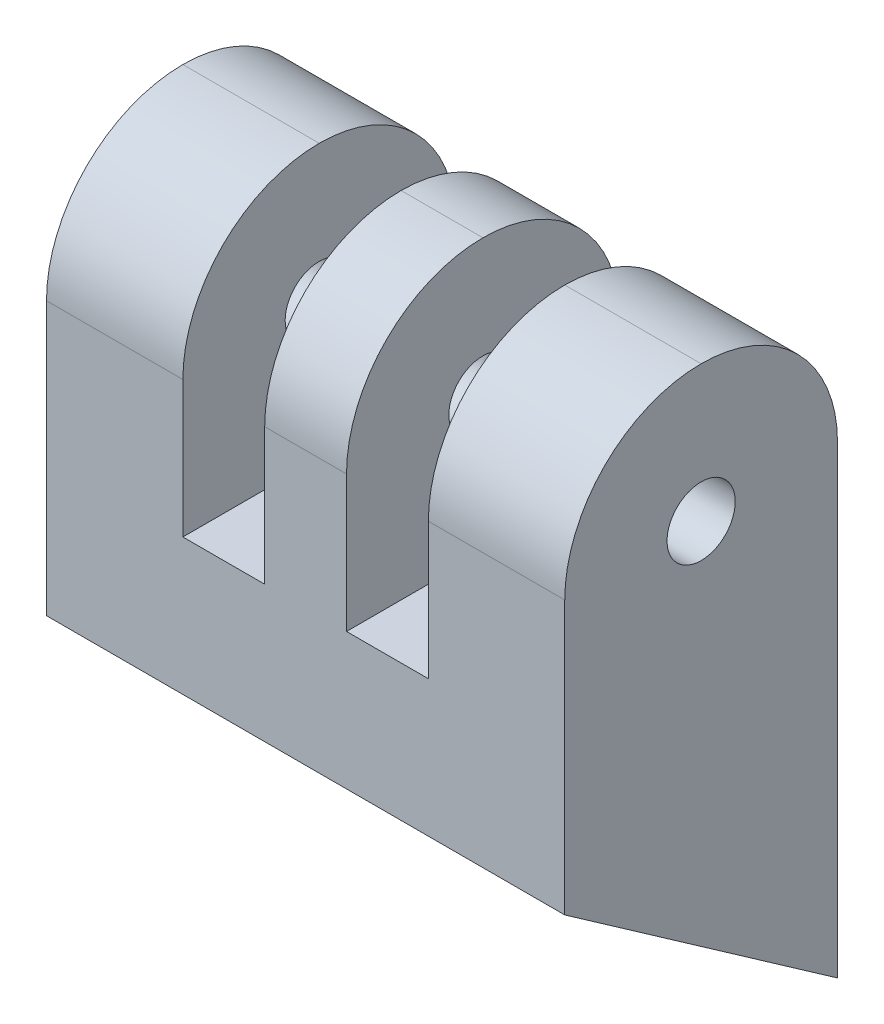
ISO-10303-21;
HEADER;
FILE_DESCRIPTION(('STEP AP214'),'2;1');
FILE_NAME('part.step','',(''),(''),'','','');
FILE_SCHEMA(('AUTOMOTIVE_DESIGN { 1 0 10303 214 1 1 1 1 }'));
ENDSEC;
DATA;
#1=APPLICATION_CONTEXT('core data for automotive mechanical design processes');
#2=APPLICATION_PROTOCOL_DEFINITION('international standard','automotive_design',2000,#1);
#3=PRODUCT_CONTEXT('',#1,'mechanical');
#4=PRODUCT('Part','Part','',(#3));
#5=PRODUCT_RELATED_PRODUCT_CATEGORY('part','',(#4));
#6=PRODUCT_DEFINITION_FORMATION('','',#4);
#7=PRODUCT_DEFINITION_CONTEXT('part definition',#1,'design');
#8=PRODUCT_DEFINITION('design','',#6,#7);
#9=PRODUCT_DEFINITION_SHAPE('','',#8);
#10=(LENGTH_UNIT() NAMED_UNIT(*) SI_UNIT(.MILLI.,.METRE.));
#11=(NAMED_UNIT(*) PLANE_ANGLE_UNIT() SI_UNIT($,.RADIAN.));
#12=(NAMED_UNIT(*) SI_UNIT($,.STERADIAN.) SOLID_ANGLE_UNIT());
#13=UNCERTAINTY_MEASURE_WITH_UNIT(LENGTH_MEASURE(1.E-05),#10,'distance_accuracy_value','');
#14=(GEOMETRIC_REPRESENTATION_CONTEXT(3) GLOBAL_UNCERTAINTY_ASSIGNED_CONTEXT((#13)) GLOBAL_UNIT_ASSIGNED_CONTEXT((#10,
#11,#12)) REPRESENTATION_CONTEXT('',''));
#15=CARTESIAN_POINT('',(0.,0.,0.));
#16=DIRECTION('',(0.,0.,1.));
#17=DIRECTION('',(1.,0.,0.));
#18=AXIS2_PLACEMENT_3D('',#15,#16,#17);
#19=CARTESIAN_POINT('',(0.,12.7,0.));
#20=DIRECTION('',(0.,-1.,0.));
#21=DIRECTION('',(0.,0.,-1.));
#22=AXIS2_PLACEMENT_3D('',#19,#20,#21);
#23=PLANE('',#22);
#24=DIRECTION('',(0.,0.,1.));
#25=VECTOR('',#24,1.);
#26=CARTESIAN_POINT('',(20.32,12.7,-25.4));
#27=LINE('',#26,#25);
#28=CARTESIAN_POINT('',(20.32,12.7,-25.4));
#29=VERTEX_POINT('',#28);
#30=CARTESIAN_POINT('',(20.32,12.7,0.));
#31=VERTEX_POINT('',#30);
#32=EDGE_CURVE('E188',#29,#31,#27,.T.);
#33=ORIENTED_EDGE('',*,*,#32,.F.);
#34=DIRECTION('',(-1.,0.,0.));
#35=VECTOR('',#34,1.);
#36=CARTESIAN_POINT('',(0.,12.7,-25.4));
#37=LINE('',#36,#35);
#38=CARTESIAN_POINT('',(12.7,12.7,-25.4));
#39=VERTEX_POINT('',#38);
#40=EDGE_CURVE('E218',#29,#39,#37,.T.);
#41=ORIENTED_EDGE('',*,*,#40,.T.);
#42=DIRECTION('',(0.,0.,-1.));
#43=VECTOR('',#42,1.);
#44=CARTESIAN_POINT('',(12.7,12.7,-25.4));
#45=LINE('',#44,#43);
#46=CARTESIAN_POINT('',(12.7,12.7,0.));
#47=VERTEX_POINT('',#46);
#48=EDGE_CURVE('E209',#47,#39,#45,.T.);
#49=ORIENTED_EDGE('',*,*,#48,.F.);
#50=DIRECTION('',(1.,0.,0.));
#51=VECTOR('',#50,1.);
#52=CARTESIAN_POINT('',(0.,12.7,0.));
#53=LINE('',#52,#51);
#54=EDGE_CURVE('E215',#47,#31,#53,.T.);
#55=ORIENTED_EDGE('',*,*,#54,.T.);
#56=EDGE_LOOP('',(#33,#41,#49,#55));
#57=FACE_BOUND('',#56,.T.);
#58=ADVANCED_FACE('F32',(#57),#23,.F.);
#59=DIRECTION('',(0.,0.,-1.));
#60=VECTOR('',#59,1.);
#61=CARTESIAN_POINT('',(27.94,12.7,-25.4));
#62=LINE('',#61,#60);
#63=CARTESIAN_POINT('',(27.94,12.7,0.));
#64=VERTEX_POINT('',#63);
#65=CARTESIAN_POINT('',(27.94,12.7,-25.4));
#66=VERTEX_POINT('',#65);
#67=EDGE_CURVE('E191',#64,#66,#62,.T.);
#68=ORIENTED_EDGE('',*,*,#67,.F.);
#69=CARTESIAN_POINT('',(35.56,12.7,0.));
#70=VERTEX_POINT('',#69);
#71=EDGE_CURVE('E159',#64,#70,#53,.T.);
#72=ORIENTED_EDGE('',*,*,#71,.T.);
#73=DIRECTION('',(0.,0.,1.));
#74=VECTOR('',#73,1.);
#75=CARTESIAN_POINT('',(35.56,12.7,-25.4));
#76=LINE('',#75,#74);
#77=CARTESIAN_POINT('',(35.56,12.7,-25.4));
#78=VERTEX_POINT('',#77);
#79=EDGE_CURVE('E202',#78,#70,#76,.T.);
#80=ORIENTED_EDGE('',*,*,#79,.F.);
#81=EDGE_CURVE('E219',#78,#66,#37,.T.);
#82=ORIENTED_EDGE('',*,*,#81,.T.);
#83=EDGE_LOOP('',(#68,#72,#80,#82));
#84=FACE_BOUND('',#83,.T.);
#85=ADVANCED_FACE('F285',(#84),#23,.F.);
#86=CARTESIAN_POINT('',(0.,12.7,0.));
#87=DIRECTION('',(1.,0.,0.));
#88=DIRECTION('',(0.,0.,-1.));
#89=AXIS2_PLACEMENT_3D('',#86,#87,#88);
#90=PLANE('',#89);
#91=CARTESIAN_POINT('',(0.,25.4,-12.7));
#92=DIRECTION('',(1.,0.,0.));
#93=DIRECTION('',(0.,0.,-1.));
#94=AXIS2_PLACEMENT_3D('',#91,#92,#93);
#95=CIRCLE('',#94,3.175);
#96=CARTESIAN_POINT('',(0.,25.4,-15.875));
#97=VERTEX_POINT('',#96);
#98=EDGE_CURVE('E185',#97,#97,#95,.T.);
#99=ORIENTED_EDGE('',*,*,#98,.T.);
#100=EDGE_LOOP('',(#99));
#101=FACE_BOUND('',#100,.T.);
#102=CARTESIAN_POINT('',(0.,25.4,-12.7));
#103=DIRECTION('',(1.,0.,0.));
#104=DIRECTION('',(0.,0.,-1.));
#105=AXIS2_PLACEMENT_3D('',#102,#103,#104);
#106=CIRCLE('',#105,12.7);
#107=CARTESIAN_POINT('',(0.,25.4,0.));
#108=VERTEX_POINT('',#107);
#109=CARTESIAN_POINT('',(0.,38.1,-12.7));
#110=VERTEX_POINT('',#109);
#111=EDGE_CURVE('E148',#108,#110,#106,.F.);
#112=ORIENTED_EDGE('',*,*,#111,.T.);
#113=CARTESIAN_POINT('',(0.,25.4,-12.7));
#114=DIRECTION('',(1.,0.,0.));
#115=DIRECTION('',(0.,0.,-1.));
#116=AXIS2_PLACEMENT_3D('',#113,#114,#115);
#117=CIRCLE('',#116,12.7);
#118=CARTESIAN_POINT('',(0.,25.4,-25.4));
#119=VERTEX_POINT('',#118);
#120=EDGE_CURVE('E229',#110,#119,#117,.F.);
#121=ORIENTED_EDGE('',*,*,#120,.T.);
#122=DIRECTION('',(0.,-1.,0.));
#123=VECTOR('',#122,1.);
#124=CARTESIAN_POINT('',(0.,12.7,-25.4));
#125=LINE('',#124,#123);
#126=CARTESIAN_POINT('',(0.,-17.7852714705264,-25.3999999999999));
#127=VERTEX_POINT('',#126);
#128=EDGE_CURVE('E164',#119,#127,#125,.T.);
#129=ORIENTED_EDGE('',*,*,#128,.T.);
#130=DIRECTION('',(0.,-0.573576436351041,-0.819152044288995));
#131=VECTOR('',#130,1.);
#132=CARTESIAN_POINT('',(0.,0.,0.));
#133=LINE('',#132,#131);
#134=CARTESIAN_POINT('',(0.,0.,0.));
#135=VERTEX_POINT('',#134);
#136=EDGE_CURVE('E156',#135,#127,#133,.T.);
#137=ORIENTED_EDGE('',*,*,#136,.F.);
#138=DIRECTION('',(0.,-1.,0.));
#139=VECTOR('',#138,1.);
#140=CARTESIAN_POINT('',(0.,12.7,0.));
#141=LINE('',#140,#139);
#142=EDGE_CURVE('E138',#108,#135,#141,.T.);
#143=ORIENTED_EDGE('',*,*,#142,.F.);
#144=EDGE_LOOP('',(#112,#121,#129,#137,#143));
#145=FACE_BOUND('',#144,.T.);
#146=ADVANCED_FACE('F162',(#101,#145),#90,.F.);
#147=CARTESIAN_POINT('',(0.,12.7,0.));
#148=DIRECTION('',(0.,0.,-1.));
#149=DIRECTION('',(-1.,0.,0.));
#150=AXIS2_PLACEMENT_3D('',#147,#148,#149);
#151=PLANE('',#150);
#152=DIRECTION('',(0.,-1.,0.));
#153=VECTOR('',#152,1.);
#154=CARTESIAN_POINT('',(48.26,12.7,0.));
#155=LINE('',#154,#153);
#156=CARTESIAN_POINT('',(48.26,25.4,0.));
#157=VERTEX_POINT('',#156);
#158=CARTESIAN_POINT('',(48.26,0.,0.));
#159=VERTEX_POINT('',#158);
#160=EDGE_CURVE('E149',#157,#159,#155,.T.);
#161=ORIENTED_EDGE('',*,*,#160,.F.);
#162=DIRECTION('',(1.,0.,0.));
#163=VECTOR('',#162,1.);
#164=CARTESIAN_POINT('',(0.,25.4,0.));
#165=LINE('',#164,#163);
#166=CARTESIAN_POINT('',(35.56,25.4,0.));
#167=VERTEX_POINT('',#166);
#168=EDGE_CURVE('E11',#157,#167,#165,.F.);
#169=ORIENTED_EDGE('',*,*,#168,.T.);
#170=DIRECTION('',(0.,-1.,0.));
#171=VECTOR('',#170,1.);
#172=CARTESIAN_POINT('',(35.56,38.1,0.));
#173=LINE('',#172,#171);
#174=EDGE_CURVE('E205',#167,#70,#173,.T.);
#175=ORIENTED_EDGE('',*,*,#174,.T.);
#176=ORIENTED_EDGE('',*,*,#71,.F.);
#177=DIRECTION('',(0.,-1.,0.));
#178=VECTOR('',#177,1.);
#179=CARTESIAN_POINT('',(27.94,38.1,0.));
#180=LINE('',#179,#178);
#181=CARTESIAN_POINT('',(27.94,25.4,0.));
#182=VERTEX_POINT('',#181);
#183=EDGE_CURVE('E198',#182,#64,#180,.T.);
#184=ORIENTED_EDGE('',*,*,#183,.F.);
#185=DIRECTION('',(1.,0.,0.));
#186=VECTOR('',#185,1.);
#187=CARTESIAN_POINT('',(20.32,25.4,0.));
#188=LINE('',#187,#186);
#189=CARTESIAN_POINT('',(20.32,25.4,0.));
#190=VERTEX_POINT('',#189);
#191=EDGE_CURVE('E41',#182,#190,#188,.F.);
#192=ORIENTED_EDGE('',*,*,#191,.T.);
#193=DIRECTION('',(0.,-1.,0.));
#194=VECTOR('',#193,1.);
#195=CARTESIAN_POINT('',(20.32,38.1,0.));
#196=LINE('',#195,#194);
#197=EDGE_CURVE('E200',#190,#31,#196,.T.);
#198=ORIENTED_EDGE('',*,*,#197,.T.);
#199=ORIENTED_EDGE('',*,*,#54,.F.);
#200=DIRECTION('',(0.,-1.,0.));
#201=VECTOR('',#200,1.);
#202=CARTESIAN_POINT('',(12.7,38.1,0.));
#203=LINE('',#202,#201);
#204=CARTESIAN_POINT('',(12.7,25.4,0.));
#205=VERTEX_POINT('',#204);
#206=EDGE_CURVE('E160',#205,#47,#203,.T.);
#207=ORIENTED_EDGE('',*,*,#206,.F.);
#208=DIRECTION('',(1.,0.,0.));
#209=VECTOR('',#208,1.);
#210=CARTESIAN_POINT('',(0.,25.4,0.));
#211=LINE('',#210,#209);
#212=EDGE_CURVE('E144',#205,#108,#211,.F.);
#213=ORIENTED_EDGE('',*,*,#212,.T.);
#214=ORIENTED_EDGE('',*,*,#142,.T.);
#215=DIRECTION('',(1.,0.,0.));
#216=VECTOR('',#215,1.);
#217=CARTESIAN_POINT('',(0.,0.,0.));
#218=LINE('',#217,#216);
#219=EDGE_CURVE('E141',#135,#159,#218,.T.);
#220=ORIENTED_EDGE('',*,*,#219,.T.);
#221=EDGE_LOOP('',(#161,#169,#175,#176,#184,#192,#198,#199,#207,#213,#214,#220));
#222=FACE_BOUND('',#221,.T.);
#223=ADVANCED_FACE('F140',(#222),#151,.F.);
#224=CARTESIAN_POINT('',(48.26,12.7,0.));
#225=DIRECTION('',(-1.,0.,0.));
#226=DIRECTION('',(0.,0.,1.));
#227=AXIS2_PLACEMENT_3D('',#224,#225,#226);
#228=PLANE('',#227);
#229=CARTESIAN_POINT('',(48.26,25.4,-12.7));
#230=DIRECTION('',(1.,0.,0.));
#231=DIRECTION('',(0.,0.,-1.));
#232=AXIS2_PLACEMENT_3D('',#229,#230,#231);
#233=CIRCLE('',#232,3.175);
#234=CARTESIAN_POINT('',(48.26,25.4,-15.875));
#235=VERTEX_POINT('',#234);
#236=EDGE_CURVE('E168',#235,#235,#233,.T.);
#237=ORIENTED_EDGE('',*,*,#236,.F.);
#238=EDGE_LOOP('',(#237));
#239=FACE_BOUND('',#238,.T.);
#240=DIRECTION('',(0.,-1.,0.));
#241=VECTOR('',#240,1.);
#242=CARTESIAN_POINT('',(48.26,12.7,-25.4));
#243=LINE('',#242,#241);
#244=CARTESIAN_POINT('',(48.26,25.4,-25.4));
#245=VERTEX_POINT('',#244);
#246=CARTESIAN_POINT('',(48.26,-17.7852714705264,-25.3999999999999));
#247=VERTEX_POINT('',#246);
#248=EDGE_CURVE('E223',#245,#247,#243,.T.);
#249=ORIENTED_EDGE('',*,*,#248,.F.);
#250=CARTESIAN_POINT('',(48.26,25.4,-12.7));
#251=DIRECTION('',(-1.,0.,0.));
#252=DIRECTION('',(0.,0.,1.));
#253=AXIS2_PLACEMENT_3D('',#250,#251,#252);
#254=CIRCLE('',#253,12.7);
#255=CARTESIAN_POINT('',(48.26,38.1,-12.7));
#256=VERTEX_POINT('',#255);
#257=EDGE_CURVE('E49',#245,#256,#254,.F.);
#258=ORIENTED_EDGE('',*,*,#257,.T.);
#259=CARTESIAN_POINT('',(48.26,25.4,-12.7));
#260=DIRECTION('',(-1.,0.,0.));
#261=DIRECTION('',(0.,0.,1.));
#262=AXIS2_PLACEMENT_3D('',#259,#260,#261);
#263=CIRCLE('',#262,12.7);
#264=EDGE_CURVE('E53',#256,#157,#263,.F.);
#265=ORIENTED_EDGE('',*,*,#264,.T.);
#266=ORIENTED_EDGE('',*,*,#160,.T.);
#267=DIRECTION('',(0.,-0.573576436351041,-0.819152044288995));
#268=VECTOR('',#267,1.);
#269=CARTESIAN_POINT('',(48.26,0.,0.));
#270=LINE('',#269,#268);
#271=EDGE_CURVE('E158',#159,#247,#270,.T.);
#272=ORIENTED_EDGE('',*,*,#271,.T.);
#273=EDGE_LOOP('',(#249,#258,#265,#266,#272));
#274=FACE_BOUND('',#273,.T.);
#275=ADVANCED_FACE('F336',(#239,#274),#228,.F.);
#276=CARTESIAN_POINT('',(0.,12.7,-25.4));
#277=DIRECTION('',(0.,0.,1.));
#278=DIRECTION('',(1.,0.,0.));
#279=AXIS2_PLACEMENT_3D('',#276,#277,#278);
#280=PLANE('',#279);
#281=ORIENTED_EDGE('',*,*,#128,.F.);
#282=DIRECTION('',(-1.,0.,0.));
#283=VECTOR('',#282,1.);
#284=CARTESIAN_POINT('',(12.7,25.4,-25.4));
#285=LINE('',#284,#283);
#286=CARTESIAN_POINT('',(12.7,25.4,-25.4));
#287=VERTEX_POINT('',#286);
#288=EDGE_CURVE('E237',#119,#287,#285,.F.);
#289=ORIENTED_EDGE('',*,*,#288,.T.);
#290=DIRECTION('',(0.,-1.,0.));
#291=VECTOR('',#290,1.);
#292=CARTESIAN_POINT('',(12.7,38.1,-25.4));
#293=LINE('',#292,#291);
#294=EDGE_CURVE('E212',#287,#39,#293,.T.);
#295=ORIENTED_EDGE('',*,*,#294,.T.);
#296=ORIENTED_EDGE('',*,*,#40,.F.);
#297=DIRECTION('',(0.,-1.,0.));
#298=VECTOR('',#297,1.);
#299=CARTESIAN_POINT('',(20.32,38.1,-25.4));
#300=LINE('',#299,#298);
#301=CARTESIAN_POINT('',(20.32,25.4,-25.4));
#302=VERTEX_POINT('',#301);
#303=EDGE_CURVE('E194',#302,#29,#300,.T.);
#304=ORIENTED_EDGE('',*,*,#303,.F.);
#305=DIRECTION('',(-1.,0.,0.));
#306=VECTOR('',#305,1.);
#307=CARTESIAN_POINT('',(27.94,25.4,-25.4));
#308=LINE('',#307,#306);
#309=CARTESIAN_POINT('',(27.94,25.4,-25.4));
#310=VERTEX_POINT('',#309);
#311=EDGE_CURVE('E234',#302,#310,#308,.F.);
#312=ORIENTED_EDGE('',*,*,#311,.T.);
#313=DIRECTION('',(0.,-1.,0.));
#314=VECTOR('',#313,1.);
#315=CARTESIAN_POINT('',(27.94,38.1,-25.4));
#316=LINE('',#315,#314);
#317=EDGE_CURVE('E196',#310,#66,#316,.T.);
#318=ORIENTED_EDGE('',*,*,#317,.T.);
#319=ORIENTED_EDGE('',*,*,#81,.F.);
#320=DIRECTION('',(0.,-1.,0.));
#321=VECTOR('',#320,1.);
#322=CARTESIAN_POINT('',(35.56,38.1,-25.4));
#323=LINE('',#322,#321);
#324=CARTESIAN_POINT('',(35.56,25.4,-25.4));
#325=VERTEX_POINT('',#324);
#326=EDGE_CURVE('E207',#325,#78,#323,.T.);
#327=ORIENTED_EDGE('',*,*,#326,.F.);
#328=DIRECTION('',(-1.,0.,0.));
#329=VECTOR('',#328,1.);
#330=CARTESIAN_POINT('',(0.,25.4,-25.4));
#331=LINE('',#330,#329);
#332=EDGE_CURVE('E231',#325,#245,#331,.F.);
#333=ORIENTED_EDGE('',*,*,#332,.T.);
#334=ORIENTED_EDGE('',*,*,#248,.T.);
#335=DIRECTION('',(1.,0.,0.));
#336=VECTOR('',#335,1.);
#337=CARTESIAN_POINT('',(0.,-17.7852714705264,-25.3999999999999));
#338=LINE('',#337,#336);
#339=EDGE_CURVE('E166',#127,#247,#338,.T.);
#340=ORIENTED_EDGE('',*,*,#339,.F.);
#341=EDGE_LOOP('',(#281,#289,#295,#296,#304,#312,#318,#319,#327,#333,#334,#340));
#342=FACE_BOUND('',#341,.T.);
#343=ADVANCED_FACE('F314',(#342),#280,.F.);
#344=CARTESIAN_POINT('',(12.7,38.1,-25.4));
#345=DIRECTION('',(-1.,0.,0.));
#346=DIRECTION('',(0.,0.,1.));
#347=AXIS2_PLACEMENT_3D('',#344,#345,#346);
#348=PLANE('',#347);
#349=CARTESIAN_POINT('',(12.7,25.4,-12.7));
#350=DIRECTION('',(-1.,0.,0.));
#351=DIRECTION('',(0.,0.,1.));
#352=AXIS2_PLACEMENT_3D('',#349,#350,#351);
#353=CIRCLE('',#352,3.175);
#354=CARTESIAN_POINT('',(12.7,25.4,-9.52499999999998));
#355=VERTEX_POINT('',#354);
#356=EDGE_CURVE('E182',#355,#355,#353,.T.);
#357=ORIENTED_EDGE('',*,*,#356,.T.);
#358=EDGE_LOOP('',(#357));
#359=FACE_BOUND('',#358,.T.);
#360=ORIENTED_EDGE('',*,*,#294,.F.);
#361=CARTESIAN_POINT('',(12.7,25.4,-12.7));
#362=DIRECTION('',(-1.,0.,0.));
#363=DIRECTION('',(0.,0.,1.));
#364=AXIS2_PLACEMENT_3D('',#361,#362,#363);
#365=CIRCLE('',#364,12.7);
#366=CARTESIAN_POINT('',(12.7,38.1,-12.7));
#367=VERTEX_POINT('',#366);
#368=EDGE_CURVE('E242',#287,#367,#365,.F.);
#369=ORIENTED_EDGE('',*,*,#368,.T.);
#370=CARTESIAN_POINT('',(12.7,25.4,-12.7));
#371=DIRECTION('',(-1.,0.,0.));
#372=DIRECTION('',(0.,0.,1.));
#373=AXIS2_PLACEMENT_3D('',#370,#371,#372);
#374=CIRCLE('',#373,12.7);
#375=EDGE_CURVE('E240',#367,#205,#374,.F.);
#376=ORIENTED_EDGE('',*,*,#375,.T.);
#377=ORIENTED_EDGE('',*,*,#206,.T.);
#378=ORIENTED_EDGE('',*,*,#48,.T.);
#379=EDGE_LOOP('',(#360,#369,#376,#377,#378));
#380=FACE_BOUND('',#379,.T.);
#381=ADVANCED_FACE('F305',(#359,#380),#348,.F.);
#382=CARTESIAN_POINT('',(35.56,38.1,-25.4));
#383=DIRECTION('',(1.,0.,0.));
#384=DIRECTION('',(0.,0.,-1.));
#385=AXIS2_PLACEMENT_3D('',#382,#383,#384);
#386=PLANE('',#385);
#387=CARTESIAN_POINT('',(35.56,25.4,-12.7));
#388=DIRECTION('',(1.,0.,0.));
#389=DIRECTION('',(0.,0.,-1.));
#390=AXIS2_PLACEMENT_3D('',#387,#388,#389);
#391=CIRCLE('',#390,3.175);
#392=CARTESIAN_POINT('',(35.56,25.4,-15.875));
#393=VERTEX_POINT('',#392);
#394=EDGE_CURVE('E179',#393,#393,#391,.T.);
#395=ORIENTED_EDGE('',*,*,#394,.T.);
#396=EDGE_LOOP('',(#395));
#397=FACE_BOUND('',#396,.T.);
#398=CARTESIAN_POINT('',(35.56,25.4,-12.7));
#399=DIRECTION('',(1.,0.,0.));
#400=DIRECTION('',(0.,0.,-1.));
#401=AXIS2_PLACEMENT_3D('',#398,#399,#400);
#402=CIRCLE('',#401,12.7);
#403=CARTESIAN_POINT('',(35.56,38.1,-12.7));
#404=VERTEX_POINT('',#403);
#405=EDGE_CURVE('E252',#167,#404,#402,.F.);
#406=ORIENTED_EDGE('',*,*,#405,.T.);
#407=CARTESIAN_POINT('',(35.56,25.4,-12.7));
#408=DIRECTION('',(1.,0.,0.));
#409=DIRECTION('',(0.,0.,-1.));
#410=AXIS2_PLACEMENT_3D('',#407,#408,#409);
#411=CIRCLE('',#410,12.7);
#412=EDGE_CURVE('E254',#404,#325,#411,.F.);
#413=ORIENTED_EDGE('',*,*,#412,.T.);
#414=ORIENTED_EDGE('',*,*,#326,.T.);
#415=ORIENTED_EDGE('',*,*,#79,.T.);
#416=ORIENTED_EDGE('',*,*,#174,.F.);
#417=EDGE_LOOP('',(#406,#413,#414,#415,#416));
#418=FACE_BOUND('',#417,.T.);
#419=ADVANCED_FACE('F279',(#397,#418),#386,.F.);
#420=CARTESIAN_POINT('',(20.32,38.1,-25.4));
#421=DIRECTION('',(1.,0.,0.));
#422=DIRECTION('',(0.,0.,-1.));
#423=AXIS2_PLACEMENT_3D('',#420,#421,#422);
#424=PLANE('',#423);
#425=CARTESIAN_POINT('',(20.32,25.4,-12.7));
#426=DIRECTION('',(1.,0.,0.));
#427=DIRECTION('',(0.,0.,-1.));
#428=AXIS2_PLACEMENT_3D('',#425,#426,#427);
#429=CIRCLE('',#428,3.175);
#430=CARTESIAN_POINT('',(20.32,25.4,-15.875));
#431=VERTEX_POINT('',#430);
#432=EDGE_CURVE('E176',#431,#431,#429,.T.);
#433=ORIENTED_EDGE('',*,*,#432,.T.);
#434=EDGE_LOOP('',(#433));
#435=FACE_BOUND('',#434,.T.);
#436=CARTESIAN_POINT('',(20.32,25.4,-12.7));
#437=DIRECTION('',(1.,0.,0.));
#438=DIRECTION('',(0.,0.,-1.));
#439=AXIS2_PLACEMENT_3D('',#436,#437,#438);
#440=CIRCLE('',#439,12.7);
#441=CARTESIAN_POINT('',(20.32,38.1,-12.7));
#442=VERTEX_POINT('',#441);
#443=EDGE_CURVE('E244',#190,#442,#440,.F.);
#444=ORIENTED_EDGE('',*,*,#443,.T.);
#445=CARTESIAN_POINT('',(20.32,25.4,-12.7));
#446=DIRECTION('',(1.,0.,0.));
#447=DIRECTION('',(0.,0.,-1.));
#448=AXIS2_PLACEMENT_3D('',#445,#446,#447);
#449=CIRCLE('',#448,12.7);
#450=EDGE_CURVE('E246',#442,#302,#449,.F.);
#451=ORIENTED_EDGE('',*,*,#450,.T.);
#452=ORIENTED_EDGE('',*,*,#303,.T.);
#453=ORIENTED_EDGE('',*,*,#32,.T.);
#454=ORIENTED_EDGE('',*,*,#197,.F.);
#455=EDGE_LOOP('',(#444,#451,#452,#453,#454));
#456=FACE_BOUND('',#455,.T.);
#457=ADVANCED_FACE('F295',(#435,#456),#424,.F.);
#458=CARTESIAN_POINT('',(27.94,38.1,-25.4));
#459=DIRECTION('',(-1.,0.,0.));
#460=DIRECTION('',(0.,0.,1.));
#461=AXIS2_PLACEMENT_3D('',#458,#459,#460);
#462=PLANE('',#461);
#463=CARTESIAN_POINT('',(27.94,25.4,-12.7));
#464=DIRECTION('',(-1.,0.,0.));
#465=DIRECTION('',(0.,0.,1.));
#466=AXIS2_PLACEMENT_3D('',#463,#464,#465);
#467=CIRCLE('',#466,3.175);
#468=CARTESIAN_POINT('',(27.94,25.4,-9.52499999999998));
#469=VERTEX_POINT('',#468);
#470=EDGE_CURVE('E175',#469,#469,#467,.T.);
#471=ORIENTED_EDGE('',*,*,#470,.T.);
#472=EDGE_LOOP('',(#471));
#473=FACE_BOUND('',#472,.T.);
#474=ORIENTED_EDGE('',*,*,#317,.F.);
#475=CARTESIAN_POINT('',(27.94,25.4,-12.7));
#476=DIRECTION('',(-1.,0.,0.));
#477=DIRECTION('',(0.,0.,1.));
#478=AXIS2_PLACEMENT_3D('',#475,#476,#477);
#479=CIRCLE('',#478,12.7);
#480=CARTESIAN_POINT('',(27.94,38.1,-12.7));
#481=VERTEX_POINT('',#480);
#482=EDGE_CURVE('E250',#310,#481,#479,.F.);
#483=ORIENTED_EDGE('',*,*,#482,.T.);
#484=CARTESIAN_POINT('',(27.94,25.4,-12.7));
#485=DIRECTION('',(-1.,0.,0.));
#486=DIRECTION('',(0.,0.,1.));
#487=AXIS2_PLACEMENT_3D('',#484,#485,#486);
#488=CIRCLE('',#487,12.7);
#489=EDGE_CURVE('E248',#481,#182,#488,.F.);
#490=ORIENTED_EDGE('',*,*,#489,.T.);
#491=ORIENTED_EDGE('',*,*,#183,.T.);
#492=ORIENTED_EDGE('',*,*,#67,.T.);
#493=EDGE_LOOP('',(#474,#483,#490,#491,#492));
#494=FACE_BOUND('',#493,.T.);
#495=ADVANCED_FACE('F363',(#473,#494),#462,.F.);
#496=CARTESIAN_POINT('',(-11.43,25.4,-12.7));
#497=DIRECTION('',(1.,0.,0.));
#498=DIRECTION('',(0.,0.,-1.));
#499=AXIS2_PLACEMENT_3D('',#496,#497,#498);
#500=CYLINDRICAL_SURFACE('',#499,3.175);
#501=ORIENTED_EDGE('',*,*,#470,.F.);
#502=EDGE_LOOP('',(#501));
#503=FACE_BOUND('',#502,.T.);
#504=ORIENTED_EDGE('',*,*,#432,.F.);
#505=EDGE_LOOP('',(#504));
#506=FACE_BOUND('',#505,.T.);
#507=ADVANCED_FACE('F353',(#503,#506),#500,.F.);
#508=ORIENTED_EDGE('',*,*,#236,.T.);
#509=EDGE_LOOP('',(#508));
#510=FACE_BOUND('',#509,.T.);
#511=ORIENTED_EDGE('',*,*,#394,.F.);
#512=EDGE_LOOP('',(#511));
#513=FACE_BOUND('',#512,.T.);
#514=ADVANCED_FACE('F350',(#510,#513),#500,.F.);
#515=ORIENTED_EDGE('',*,*,#356,.F.);
#516=EDGE_LOOP('',(#515));
#517=FACE_BOUND('',#516,.T.);
#518=ORIENTED_EDGE('',*,*,#98,.F.);
#519=EDGE_LOOP('',(#518));
#520=FACE_BOUND('',#519,.T.);
#521=ADVANCED_FACE('F348',(#517,#520),#500,.F.);
#522=CARTESIAN_POINT('',(0.,0.,0.));
#523=DIRECTION('',(0.,-0.819152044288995,0.573576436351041));
#524=DIRECTION('',(0.,-0.573576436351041,-0.819152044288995));
#525=AXIS2_PLACEMENT_3D('',#522,#523,#524);
#526=PLANE('',#525);
#527=ORIENTED_EDGE('',*,*,#271,.F.);
#528=ORIENTED_EDGE('',*,*,#219,.F.);
#529=ORIENTED_EDGE('',*,*,#136,.T.);
#530=ORIENTED_EDGE('',*,*,#339,.T.);
#531=EDGE_LOOP('',(#527,#528,#529,#530));
#532=FACE_BOUND('',#531,.T.);
#533=ADVANCED_FACE('F154',(#532),#526,.T.);
#534=CARTESIAN_POINT('',(0.,25.4,-12.7));
#535=DIRECTION('',(-1.,0.,0.));
#536=DIRECTION('',(0.,0.,1.));
#537=AXIS2_PLACEMENT_3D('',#534,#535,#536);
#538=CYLINDRICAL_SURFACE('',#537,12.7);
#539=ORIENTED_EDGE('',*,*,#212,.F.);
#540=ORIENTED_EDGE('',*,*,#375,.F.);
#541=DIRECTION('',(1.,0.,0.));
#542=VECTOR('',#541,1.);
#543=CARTESIAN_POINT('',(12.7,38.1,-12.7));
#544=LINE('',#543,#542);
#545=EDGE_CURVE('E170',#110,#367,#544,.T.);
#546=ORIENTED_EDGE('',*,*,#545,.F.);
#547=ORIENTED_EDGE('',*,*,#111,.F.);
#548=EDGE_LOOP('',(#539,#540,#546,#547));
#549=FACE_BOUND('',#548,.T.);
#550=ADVANCED_FACE('F308',(#549),#538,.T.);
#551=CARTESIAN_POINT('',(0.,25.4,-12.7));
#552=DIRECTION('',(1.,0.,0.));
#553=DIRECTION('',(0.,0.,-1.));
#554=AXIS2_PLACEMENT_3D('',#551,#552,#553);
#555=CYLINDRICAL_SURFACE('',#554,12.7);
#556=ORIENTED_EDGE('',*,*,#368,.F.);
#557=ORIENTED_EDGE('',*,*,#288,.F.);
#558=ORIENTED_EDGE('',*,*,#120,.F.);
#559=ORIENTED_EDGE('',*,*,#545,.T.);
#560=EDGE_LOOP('',(#556,#557,#558,#559));
#561=FACE_BOUND('',#560,.T.);
#562=ADVANCED_FACE('F315',(#561),#555,.T.);
#563=CARTESIAN_POINT('',(0.,25.4,-12.7));
#564=DIRECTION('',(-1.,0.,0.));
#565=DIRECTION('',(0.,0.,1.));
#566=AXIS2_PLACEMENT_3D('',#563,#564,#565);
#567=CYLINDRICAL_SURFACE('',#566,12.7);
#568=ORIENTED_EDGE('',*,*,#191,.F.);
#569=ORIENTED_EDGE('',*,*,#489,.F.);
#570=DIRECTION('',(1.,0.,0.));
#571=VECTOR('',#570,1.);
#572=CARTESIAN_POINT('',(27.94,38.1,-12.7));
#573=LINE('',#572,#571);
#574=EDGE_CURVE('E261',#442,#481,#573,.T.);
#575=ORIENTED_EDGE('',*,*,#574,.F.);
#576=ORIENTED_EDGE('',*,*,#443,.F.);
#577=EDGE_LOOP('',(#568,#569,#575,#576));
#578=FACE_BOUND('',#577,.T.);
#579=ADVANCED_FACE('F293',(#578),#567,.T.);
#580=CARTESIAN_POINT('',(0.,25.4,-12.7));
#581=DIRECTION('',(1.,0.,0.));
#582=DIRECTION('',(0.,0.,-1.));
#583=AXIS2_PLACEMENT_3D('',#580,#581,#582);
#584=CYLINDRICAL_SURFACE('',#583,12.7);
#585=ORIENTED_EDGE('',*,*,#482,.F.);
#586=ORIENTED_EDGE('',*,*,#311,.F.);
#587=ORIENTED_EDGE('',*,*,#450,.F.);
#588=ORIENTED_EDGE('',*,*,#574,.T.);
#589=EDGE_LOOP('',(#585,#586,#587,#588));
#590=FACE_BOUND('',#589,.T.);
#591=ADVANCED_FACE('F322',(#590),#584,.T.);
#592=CARTESIAN_POINT('',(0.,25.4,-12.7));
#593=DIRECTION('',(1.,0.,0.));
#594=DIRECTION('',(0.,0.,-1.));
#595=AXIS2_PLACEMENT_3D('',#592,#593,#594);
#596=CYLINDRICAL_SURFACE('',#595,12.7);
#597=ORIENTED_EDGE('',*,*,#168,.F.);
#598=ORIENTED_EDGE('',*,*,#264,.F.);
#599=DIRECTION('',(1.,0.,0.));
#600=VECTOR('',#599,1.);
#601=CARTESIAN_POINT('',(0.,38.1,-12.7));
#602=LINE('',#601,#600);
#603=EDGE_CURVE('E36',#404,#256,#602,.T.);
#604=ORIENTED_EDGE('',*,*,#603,.F.);
#605=ORIENTED_EDGE('',*,*,#405,.F.);
#606=EDGE_LOOP('',(#597,#598,#604,#605));
#607=FACE_BOUND('',#606,.T.);
#608=ADVANCED_FACE('F34',(#607),#596,.T.);
#609=CARTESIAN_POINT('',(0.,25.4,-12.7));
#610=DIRECTION('',(-1.,0.,0.));
#611=DIRECTION('',(0.,0.,1.));
#612=AXIS2_PLACEMENT_3D('',#609,#610,#611);
#613=CYLINDRICAL_SURFACE('',#612,12.7);
#614=ORIENTED_EDGE('',*,*,#257,.F.);
#615=ORIENTED_EDGE('',*,*,#332,.F.);
#616=ORIENTED_EDGE('',*,*,#412,.F.);
#617=ORIENTED_EDGE('',*,*,#603,.T.);
#618=EDGE_LOOP('',(#614,#615,#616,#617));
#619=FACE_BOUND('',#618,.T.);
#620=ADVANCED_FACE('F270',(#619),#613,.T.);
#621=CLOSED_SHELL('',(#58,#85,#146,#223,#275,#343,#381,#419,#457,#495,#507,#514,#521,#533,#550,
#562,#579,#591,#608,#620));
#622=MANIFOLD_SOLID_BREP('B2',#621);
#623=ADVANCED_BREP_SHAPE_REPRESENTATION('',(#18,#622),#14);
#624=SHAPE_DEFINITION_REPRESENTATION(#9,#623);
ENDSEC;
END-ISO-10303-21;
